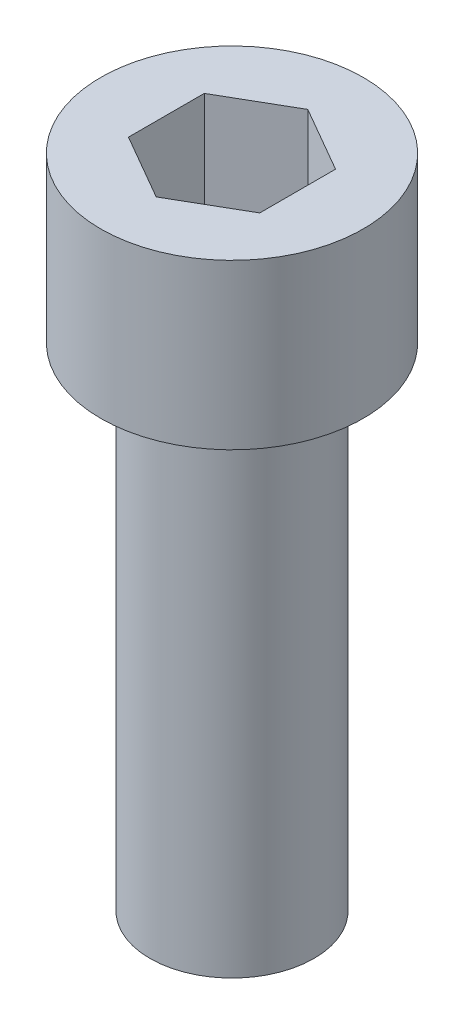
ISO-10303-21;
HEADER;
FILE_DESCRIPTION(('STEP AP214'),'2;1');
FILE_NAME('part.step','',(''),(''),'','','');
FILE_SCHEMA(('AUTOMOTIVE_DESIGN { 1 0 10303 214 1 1 1 1 }'));
ENDSEC;
DATA;
#1=APPLICATION_CONTEXT('core data for automotive mechanical design processes');
#2=APPLICATION_PROTOCOL_DEFINITION('international standard','automotive_design',2000,#1);
#3=PRODUCT_CONTEXT('',#1,'mechanical');
#4=PRODUCT('Part','Part','',(#3));
#5=PRODUCT_RELATED_PRODUCT_CATEGORY('part','',(#4));
#6=PRODUCT_DEFINITION_FORMATION('','',#4);
#7=PRODUCT_DEFINITION_CONTEXT('part definition',#1,'design');
#8=PRODUCT_DEFINITION('design','',#6,#7);
#9=PRODUCT_DEFINITION_SHAPE('','',#8);
#10=(LENGTH_UNIT() NAMED_UNIT(*) SI_UNIT(.MILLI.,.METRE.));
#11=(NAMED_UNIT(*) PLANE_ANGLE_UNIT() SI_UNIT($,.RADIAN.));
#12=(NAMED_UNIT(*) SI_UNIT($,.STERADIAN.) SOLID_ANGLE_UNIT());
#13=UNCERTAINTY_MEASURE_WITH_UNIT(LENGTH_MEASURE(1.E-05),#10,'distance_accuracy_value','');
#14=(GEOMETRIC_REPRESENTATION_CONTEXT(3) GLOBAL_UNCERTAINTY_ASSIGNED_CONTEXT((#13)) GLOBAL_UNIT_ASSIGNED_CONTEXT((#10,
#11,#12)) REPRESENTATION_CONTEXT('',''));
#15=CARTESIAN_POINT('',(0.,0.,0.));
#16=DIRECTION('',(0.,0.,1.));
#17=DIRECTION('',(1.,0.,0.));
#18=AXIS2_PLACEMENT_3D('',#15,#16,#17);
#19=CARTESIAN_POINT('',(0.,-30.,1.52655665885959E-13));
#20=DIRECTION('',(0.,1.,0.));
#21=DIRECTION('',(0.,0.,1.));
#22=AXIS2_PLACEMENT_3D('',#19,#20,#21);
#23=PLANE('',#22);
#24=CARTESIAN_POINT('',(0.,-30.,0.));
#25=DIRECTION('',(0.,1.,0.));
#26=DIRECTION('',(0.,0.,1.));
#27=AXIS2_PLACEMENT_3D('',#24,#25,#26);
#28=CIRCLE('',#27,5.0000000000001);
#29=CARTESIAN_POINT('',(0.,-30.,5.00000000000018));
#30=VERTEX_POINT('',#29);
#31=EDGE_CURVE('E10',#30,#30,#28,.T.);
#32=ORIENTED_EDGE('',*,*,#31,.F.);
#33=EDGE_LOOP('',(#32));
#34=FACE_BOUND('',#33,.T.);
#35=ADVANCED_FACE('F16',(#34),#23,.F.);
#36=CARTESIAN_POINT('',(0.,1.11022302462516E-13,0.));
#37=DIRECTION('',(0.,1.,0.));
#38=DIRECTION('',(0.,0.,1.));
#39=AXIS2_PLACEMENT_3D('',#36,#37,#38);
#40=CYLINDRICAL_SURFACE('',#39,5.0000000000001);
#41=CARTESIAN_POINT('',(0.,1.12618248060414E-13,0.));
#42=DIRECTION('',(0.,1.,0.));
#43=DIRECTION('',(0.,0.,1.));
#44=AXIS2_PLACEMENT_3D('',#41,#42,#43);
#45=CIRCLE('',#44,5.0000000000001);
#46=CARTESIAN_POINT('',(0.,1.11768233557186E-13,5.00000000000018));
#47=VERTEX_POINT('',#46);
#48=EDGE_CURVE('E111',#47,#47,#45,.F.);
#49=ORIENTED_EDGE('',*,*,#48,.T.);
#50=EDGE_LOOP('',(#49));
#51=FACE_BOUND('',#50,.T.);
#52=ORIENTED_EDGE('',*,*,#31,.T.);
#53=EDGE_LOOP('',(#52));
#54=FACE_BOUND('',#53,.T.);
#55=ADVANCED_FACE('F18',(#51,#54),#40,.T.);
#56=CARTESIAN_POINT('',(4.,2.89999999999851,-6.92820323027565));
#57=DIRECTION('',(0.,-1.,0.));
#58=DIRECTION('',(0.,0.,-1.));
#59=AXIS2_PLACEMENT_3D('',#56,#57,#58);
#60=PLANE('',#59);
#61=DIRECTION('',(0.,0.,1.));
#62=VECTOR('',#61,1.);
#63=CARTESIAN_POINT('',(-4.00000000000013,2.90000000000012,-2.30940107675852));
#64=LINE('',#63,#62);
#65=CARTESIAN_POINT('',(-4.00000000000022,2.89999999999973,-2.30940107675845));
#66=VERTEX_POINT('',#65);
#67=CARTESIAN_POINT('',(-4.00000000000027,2.89999999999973,2.30940107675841));
#68=VERTEX_POINT('',#67);
#69=EDGE_CURVE('E108',#66,#68,#64,.T.);
#70=ORIENTED_EDGE('',*,*,#69,.T.);
#71=DIRECTION('',(0.866025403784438,0.,0.5));
#72=VECTOR('',#71,1.);
#73=CARTESIAN_POINT('',(-4.00000000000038,2.90000000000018,2.30940107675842));
#74=LINE('',#73,#72);
#75=CARTESIAN_POINT('',(-1.52059354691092E-13,2.89999999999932,4.6188021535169));
#76=VERTEX_POINT('',#75);
#77=EDGE_CURVE('E102',#68,#76,#74,.T.);
#78=ORIENTED_EDGE('',*,*,#77,.T.);
#79=DIRECTION('',(-0.866025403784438,0.,0.5));
#80=VECTOR('',#79,1.);
#81=CARTESIAN_POINT('',(3.99999999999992,2.90000000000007,2.30940107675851));
#82=LINE('',#81,#80);
#83=CARTESIAN_POINT('',(4.,2.89999999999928,2.30940107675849));
#84=VERTEX_POINT('',#83);
#85=EDGE_CURVE('E100',#84,#76,#82,.T.);
#86=ORIENTED_EDGE('',*,*,#85,.F.);
#87=DIRECTION('',(0.,0.,1.));
#88=VECTOR('',#87,1.);
#89=CARTESIAN_POINT('',(4.,2.9,-2.30940107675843));
#90=LINE('',#89,#88);
#91=CARTESIAN_POINT('',(3.99999999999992,2.89999999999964,-2.30940107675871));
#92=VERTEX_POINT('',#91);
#93=EDGE_CURVE('E73',#92,#84,#90,.T.);
#94=ORIENTED_EDGE('',*,*,#93,.F.);
#95=DIRECTION('',(-0.866025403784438,0.,-0.5));
#96=VECTOR('',#95,1.);
#97=CARTESIAN_POINT('',(4.,2.9,-2.30940107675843));
#98=LINE('',#97,#96);
#99=CARTESIAN_POINT('',(-1.25550611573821E-13,2.89999999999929,-4.61880215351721));
#100=VERTEX_POINT('',#99);
#101=EDGE_CURVE('E94',#92,#100,#98,.T.);
#102=ORIENTED_EDGE('',*,*,#101,.T.);
#103=DIRECTION('',(0.866025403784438,0.,-0.5));
#104=VECTOR('',#103,1.);
#105=CARTESIAN_POINT('',(-4.00000000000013,2.90000000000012,-2.30940107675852));
#106=LINE('',#105,#104);
#107=EDGE_CURVE('E88',#66,#100,#106,.T.);
#108=ORIENTED_EDGE('',*,*,#107,.F.);
#109=EDGE_LOOP('',(#70,#78,#86,#94,#102,#108));
#110=FACE_BOUND('',#109,.T.);
#111=ADVANCED_FACE('F141',(#110),#60,.F.);
#112=CARTESIAN_POINT('',(-4.00000000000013,2.90000000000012,-2.30940107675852));
#113=DIRECTION('',(0.5,0.,0.866025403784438));
#114=DIRECTION('',(0.866025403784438,0.,-0.5));
#115=AXIS2_PLACEMENT_3D('',#112,#113,#114);
#116=PLANE('',#115);
#117=ORIENTED_EDGE('',*,*,#107,.T.);
#118=DIRECTION('',(0.,1.,0.));
#119=VECTOR('',#118,1.);
#120=CARTESIAN_POINT('',(0.,2.90000000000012,-4.61880215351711));
#121=LINE('',#120,#119);
#122=CARTESIAN_POINT('',(-1.60362088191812E-13,10.,-4.61880215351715));
#123=VERTEX_POINT('',#122);
#124=EDGE_CURVE('E86',#100,#123,#121,.T.);
#125=ORIENTED_EDGE('',*,*,#124,.T.);
#126=DIRECTION('',(-0.866025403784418,0.,0.500000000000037));
#127=VECTOR('',#126,1.);
#128=CARTESIAN_POINT('',(-1.38777878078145E-13,10.0000000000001,-4.6188021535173));
#129=LINE('',#128,#127);
#130=CARTESIAN_POINT('',(-4.0000000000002,10.0000000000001,-2.30940107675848));
#131=VERTEX_POINT('',#130);
#132=EDGE_CURVE('E79',#123,#131,#129,.T.);
#133=ORIENTED_EDGE('',*,*,#132,.T.);
#134=DIRECTION('',(0.,1.,0.));
#135=VECTOR('',#134,1.);
#136=CARTESIAN_POINT('',(-4.00000000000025,2.90000000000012,-2.30940107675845));
#137=LINE('',#136,#135);
#138=EDGE_CURVE('E91',#131,#66,#137,.F.);
#139=ORIENTED_EDGE('',*,*,#138,.T.);
#140=EDGE_LOOP('',(#117,#125,#133,#139));
#141=FACE_BOUND('',#140,.T.);
#142=ADVANCED_FACE('F149',(#141),#116,.T.);
#143=CARTESIAN_POINT('',(-4.00000000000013,2.90000000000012,-2.30940107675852));
#144=DIRECTION('',(-1.,0.,0.));
#145=DIRECTION('',(0.,0.,1.));
#146=AXIS2_PLACEMENT_3D('',#143,#144,#145);
#147=PLANE('',#146);
#148=DIRECTION('',(0.,1.,0.));
#149=VECTOR('',#148,1.);
#150=CARTESIAN_POINT('',(-4.00000000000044,2.90000000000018,2.30940107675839));
#151=LINE('',#150,#149);
#152=CARTESIAN_POINT('',(-4.00000000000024,10.,2.30940107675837));
#153=VERTEX_POINT('',#152);
#154=EDGE_CURVE('E105',#153,#68,#151,.F.);
#155=ORIENTED_EDGE('',*,*,#154,.T.);
#156=ORIENTED_EDGE('',*,*,#69,.F.);
#157=ORIENTED_EDGE('',*,*,#138,.F.);
#158=DIRECTION('',(0.,0.,-1.));
#159=VECTOR('',#158,1.);
#160=CARTESIAN_POINT('',(-4.00000000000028,10.0000000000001,0.));
#161=LINE('',#160,#159);
#162=EDGE_CURVE('E84',#131,#153,#161,.F.);
#163=ORIENTED_EDGE('',*,*,#162,.T.);
#164=EDGE_LOOP('',(#155,#156,#157,#163));
#165=FACE_BOUND('',#164,.T.);
#166=ADVANCED_FACE('F162',(#165),#147,.F.);
#167=CARTESIAN_POINT('',(-4.00000000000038,2.90000000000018,2.30940107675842));
#168=DIRECTION('',(-0.5,0.,0.866025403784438));
#169=DIRECTION('',(0.866025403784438,0.,0.5));
#170=AXIS2_PLACEMENT_3D('',#167,#168,#169);
#171=PLANE('',#170);
#172=DIRECTION('',(0.,1.,0.));
#173=VECTOR('',#172,1.);
#174=CARTESIAN_POINT('',(0.,2.90000000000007,4.618802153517));
#175=LINE('',#174,#173);
#176=CARTESIAN_POINT('',(-1.6011556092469E-13,10.,4.61880215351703));
#177=VERTEX_POINT('',#176);
#178=EDGE_CURVE('E62',#76,#177,#175,.T.);
#179=ORIENTED_EDGE('',*,*,#178,.F.);
#180=ORIENTED_EDGE('',*,*,#77,.F.);
#181=ORIENTED_EDGE('',*,*,#154,.F.);
#182=DIRECTION('',(0.866025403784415,0.,0.500000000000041));
#183=VECTOR('',#182,1.);
#184=CARTESIAN_POINT('',(-4.00000000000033,10.0000000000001,2.30940107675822));
#185=LINE('',#184,#183);
#186=EDGE_CURVE('E67',#153,#177,#185,.T.);
#187=ORIENTED_EDGE('',*,*,#186,.T.);
#188=EDGE_LOOP('',(#179,#180,#181,#187));
#189=FACE_BOUND('',#188,.T.);
#190=ADVANCED_FACE('F169',(#189),#171,.F.);
#191=CARTESIAN_POINT('',(3.99999999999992,2.90000000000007,2.30940107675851));
#192=DIRECTION('',(-0.5,0.,-0.866025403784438));
#193=DIRECTION('',(-0.866025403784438,0.,0.5));
#194=AXIS2_PLACEMENT_3D('',#191,#192,#193);
#195=PLANE('',#194);
#196=ORIENTED_EDGE('',*,*,#85,.T.);
#197=ORIENTED_EDGE('',*,*,#178,.T.);
#198=DIRECTION('',(0.866025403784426,0.,-0.500000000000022));
#199=VECTOR('',#198,1.);
#200=CARTESIAN_POINT('',(0.,10.0000000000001,4.61880215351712));
#201=LINE('',#200,#199);
#202=CARTESIAN_POINT('',(3.99999999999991,10.,2.30940107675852));
#203=VERTEX_POINT('',#202);
#204=EDGE_CURVE('E54',#177,#203,#201,.T.);
#205=ORIENTED_EDGE('',*,*,#204,.T.);
#206=DIRECTION('',(0.,1.,0.));
#207=VECTOR('',#206,1.);
#208=CARTESIAN_POINT('',(4.,2.9,2.30940107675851));
#209=LINE('',#208,#207);
#210=EDGE_CURVE('E59',#84,#203,#209,.T.);
#211=ORIENTED_EDGE('',*,*,#210,.F.);
#212=EDGE_LOOP('',(#196,#197,#205,#211));
#213=FACE_BOUND('',#212,.T.);
#214=ADVANCED_FACE('F57',(#213),#195,.T.);
#215=CARTESIAN_POINT('',(4.,2.9,-2.30940107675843));
#216=DIRECTION('',(-1.,0.,0.));
#217=DIRECTION('',(0.,0.,1.));
#218=AXIS2_PLACEMENT_3D('',#215,#216,#217);
#219=PLANE('',#218);
#220=ORIENTED_EDGE('',*,*,#93,.T.);
#221=ORIENTED_EDGE('',*,*,#210,.T.);
#222=DIRECTION('',(0.,0.,-1.));
#223=VECTOR('',#222,1.);
#224=CARTESIAN_POINT('',(3.99999999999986,10.0000000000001,0.));
#225=LINE('',#224,#223);
#226=CARTESIAN_POINT('',(3.99999999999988,10.,-2.30940107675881));
#227=VERTEX_POINT('',#226);
#228=EDGE_CURVE('E66',#203,#227,#225,.T.);
#229=ORIENTED_EDGE('',*,*,#228,.T.);
#230=DIRECTION('',(0.,1.,0.));
#231=VECTOR('',#230,1.);
#232=CARTESIAN_POINT('',(3.99999999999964,2.9,-2.30940107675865));
#233=LINE('',#232,#231);
#234=EDGE_CURVE('E74',#227,#92,#233,.F.);
#235=ORIENTED_EDGE('',*,*,#234,.T.);
#236=EDGE_LOOP('',(#220,#221,#229,#235));
#237=FACE_BOUND('',#236,.T.);
#238=ADVANCED_FACE('F70',(#237),#219,.T.);
#239=CARTESIAN_POINT('',(4.,2.9,-2.30940107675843));
#240=DIRECTION('',(0.5,0.,-0.866025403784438));
#241=DIRECTION('',(-0.866025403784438,0.,-0.5));
#242=AXIS2_PLACEMENT_3D('',#239,#240,#241);
#243=PLANE('',#242);
#244=ORIENTED_EDGE('',*,*,#124,.F.);
#245=ORIENTED_EDGE('',*,*,#101,.F.);
#246=ORIENTED_EDGE('',*,*,#234,.F.);
#247=DIRECTION('',(-0.866025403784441,0.,-0.5));
#248=VECTOR('',#247,1.);
#249=CARTESIAN_POINT('',(3.99999999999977,10.0000000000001,-2.30940107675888));
#250=LINE('',#249,#248);
#251=EDGE_CURVE('E32',#227,#123,#250,.T.);
#252=ORIENTED_EDGE('',*,*,#251,.T.);
#253=EDGE_LOOP('',(#244,#245,#246,#252));
#254=FACE_BOUND('',#253,.T.);
#255=ADVANCED_FACE('F122',(#254),#243,.F.);
#256=CARTESIAN_POINT('',(7.5999999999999,10.0000000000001,0.));
#257=DIRECTION('',(0.,-1.,0.));
#258=DIRECTION('',(0.,0.,-1.));
#259=AXIS2_PLACEMENT_3D('',#256,#257,#258);
#260=PLANE('',#259);
#261=CARTESIAN_POINT('',(0.,10.0000000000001,0.));
#262=DIRECTION('',(0.,-1.,0.));
#263=DIRECTION('',(0.,0.,-1.));
#264=AXIS2_PLACEMENT_3D('',#261,#262,#263);
#265=CIRCLE('',#264,8.00000000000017);
#266=CARTESIAN_POINT('',(0.,10.0000000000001,-8.00000000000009));
#267=VERTEX_POINT('',#266);
#268=EDGE_CURVE('E25',#267,#267,#265,.T.);
#269=ORIENTED_EDGE('',*,*,#268,.F.);
#270=EDGE_LOOP('',(#269));
#271=FACE_BOUND('',#270,.T.);
#272=ORIENTED_EDGE('',*,*,#251,.F.);
#273=ORIENTED_EDGE('',*,*,#228,.F.);
#274=ORIENTED_EDGE('',*,*,#204,.F.);
#275=ORIENTED_EDGE('',*,*,#186,.F.);
#276=ORIENTED_EDGE('',*,*,#162,.F.);
#277=ORIENTED_EDGE('',*,*,#132,.F.);
#278=EDGE_LOOP('',(#272,#273,#274,#275,#276,#277));
#279=FACE_BOUND('',#278,.T.);
#280=ADVANCED_FACE('F76',(#271,#279),#260,.F.);
#281=CARTESIAN_POINT('',(0.,1.11022302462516E-13,0.));
#282=DIRECTION('',(0.,1.,0.));
#283=DIRECTION('',(0.,0.,1.));
#284=AXIS2_PLACEMENT_3D('',#281,#282,#283);
#285=CYLINDRICAL_SURFACE('',#284,8.00000000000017);
#286=CARTESIAN_POINT('',(0.,1.13575815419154E-13,0.));
#287=DIRECTION('',(0.,1.,0.));
#288=DIRECTION('',(0.,0.,1.));
#289=AXIS2_PLACEMENT_3D('',#286,#287,#288);
#290=CIRCLE('',#289,8.00000000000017);
#291=CARTESIAN_POINT('',(0.,1.12215792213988E-13,8.00000000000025));
#292=VERTEX_POINT('',#291);
#293=EDGE_CURVE('E114',#292,#292,#290,.T.);
#294=ORIENTED_EDGE('',*,*,#293,.T.);
#295=EDGE_LOOP('',(#294));
#296=FACE_BOUND('',#295,.T.);
#297=ORIENTED_EDGE('',*,*,#268,.T.);
#298=EDGE_LOOP('',(#297));
#299=FACE_BOUND('',#298,.T.);
#300=ADVANCED_FACE('F119',(#296,#299),#285,.T.);
#301=CARTESIAN_POINT('',(5.,1.11022302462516E-13,0.));
#302=DIRECTION('',(0.,1.,0.));
#303=DIRECTION('',(0.,0.,1.));
#304=AXIS2_PLACEMENT_3D('',#301,#302,#303);
#305=PLANE('',#304);
#306=ORIENTED_EDGE('',*,*,#48,.F.);
#307=EDGE_LOOP('',(#306));
#308=FACE_BOUND('',#307,.T.);
#309=ORIENTED_EDGE('',*,*,#293,.F.);
#310=EDGE_LOOP('',(#309));
#311=FACE_BOUND('',#310,.T.);
#312=ADVANCED_FACE('F130',(#308,#311),#305,.F.);
#313=CLOSED_SHELL('',(#35,#55,#111,#142,#166,#190,#214,#238,#255,#280,#300,#312));
#314=MANIFOLD_SOLID_BREP('B1',#313);
#315=ADVANCED_BREP_SHAPE_REPRESENTATION('',(#18,#314),#14);
#316=SHAPE_DEFINITION_REPRESENTATION(#9,#315);
ENDSEC;
END-ISO-10303-21;
